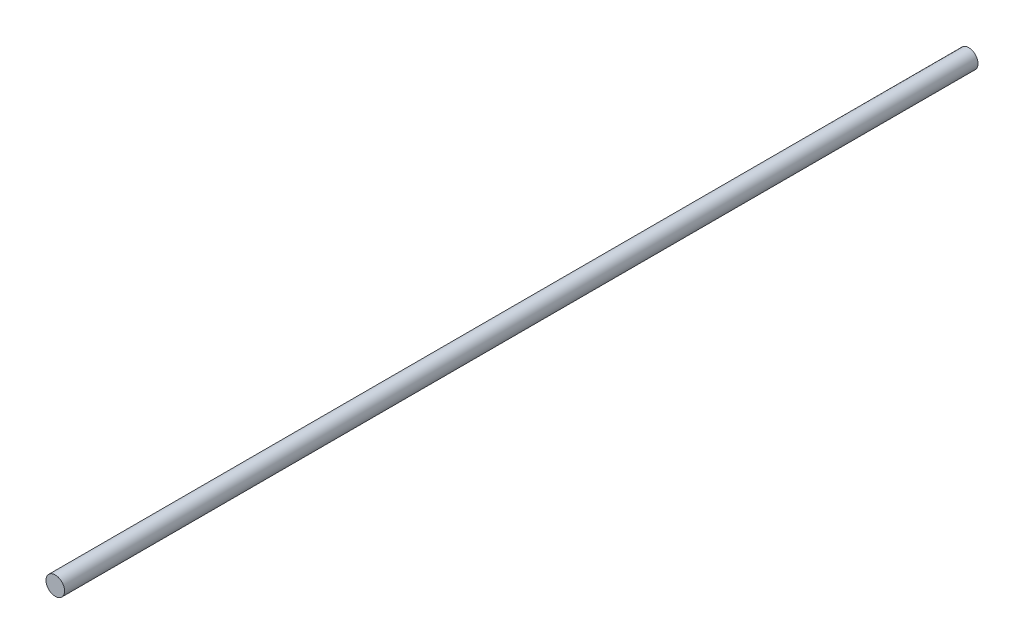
ISO-10303-21;
HEADER;
FILE_DESCRIPTION(('STEP AP214'),'2;1');
FILE_NAME('part.step','',(''),(''),'','','');
FILE_SCHEMA(('AUTOMOTIVE_DESIGN { 1 0 10303 214 1 1 1 1 }'));
ENDSEC;
DATA;
#1=APPLICATION_CONTEXT('core data for automotive mechanical design processes');
#2=APPLICATION_PROTOCOL_DEFINITION('international standard','automotive_design',2000,#1);
#3=PRODUCT_CONTEXT('',#1,'mechanical');
#4=PRODUCT('Part','Part','',(#3));
#5=PRODUCT_RELATED_PRODUCT_CATEGORY('part','',(#4));
#6=PRODUCT_DEFINITION_FORMATION('','',#4);
#7=PRODUCT_DEFINITION_CONTEXT('part definition',#1,'design');
#8=PRODUCT_DEFINITION('design','',#6,#7);
#9=PRODUCT_DEFINITION_SHAPE('','',#8);
#10=(LENGTH_UNIT() NAMED_UNIT(*) SI_UNIT(.MILLI.,.METRE.));
#11=(NAMED_UNIT(*) PLANE_ANGLE_UNIT() SI_UNIT($,.RADIAN.));
#12=(NAMED_UNIT(*) SI_UNIT($,.STERADIAN.) SOLID_ANGLE_UNIT());
#13=UNCERTAINTY_MEASURE_WITH_UNIT(LENGTH_MEASURE(1.E-05),#10,'distance_accuracy_value','');
#14=(GEOMETRIC_REPRESENTATION_CONTEXT(3) GLOBAL_UNCERTAINTY_ASSIGNED_CONTEXT((#13)) GLOBAL_UNIT_ASSIGNED_CONTEXT((#10,
#11,#12)) REPRESENTATION_CONTEXT('',''));
#15=CARTESIAN_POINT('',(0.,0.,0.));
#16=DIRECTION('',(0.,0.,1.));
#17=DIRECTION('',(1.,0.,0.));
#18=AXIS2_PLACEMENT_3D('',#15,#16,#17);
#19=CARTESIAN_POINT('',(0.,0.,-2950.));
#20=DIRECTION('',(0.,0.,1.));
#21=DIRECTION('',(1.,0.,0.));
#22=AXIS2_PLACEMENT_3D('',#19,#20,#21);
#23=CYLINDRICAL_SURFACE('',#22,30.);
#24=CARTESIAN_POINT('',(0.,0.,-2950.));
#25=DIRECTION('',(0.,0.,1.));
#26=DIRECTION('',(1.,0.,0.));
#27=AXIS2_PLACEMENT_3D('',#24,#25,#26);
#28=CIRCLE('',#27,30.);
#29=CARTESIAN_POINT('',(30.,0.,-2950.));
#30=VERTEX_POINT('',#29);
#31=EDGE_CURVE('E10',#30,#30,#28,.T.);
#32=ORIENTED_EDGE('',*,*,#31,.T.);
#33=EDGE_LOOP('',(#32));
#34=FACE_BOUND('',#33,.T.);
#35=CARTESIAN_POINT('',(0.,0.,0.));
#36=DIRECTION('',(0.,0.,1.));
#37=DIRECTION('',(1.,0.,0.));
#38=AXIS2_PLACEMENT_3D('',#35,#36,#37);
#39=CIRCLE('',#38,30.);
#40=CARTESIAN_POINT('',(30.,0.,0.));
#41=VERTEX_POINT('',#40);
#42=EDGE_CURVE('E40',#41,#41,#39,.T.);
#43=ORIENTED_EDGE('',*,*,#42,.F.);
#44=EDGE_LOOP('',(#43));
#45=FACE_BOUND('',#44,.T.);
#46=ADVANCED_FACE('F37',(#34,#45),#23,.T.);
#47=CARTESIAN_POINT('',(0.,0.,-2950.));
#48=DIRECTION('',(0.,0.,1.));
#49=DIRECTION('',(1.,0.,0.));
#50=AXIS2_PLACEMENT_3D('',#47,#48,#49);
#51=PLANE('',#50);
#52=ORIENTED_EDGE('',*,*,#31,.F.);
#53=EDGE_LOOP('',(#52));
#54=FACE_BOUND('',#53,.T.);
#55=ADVANCED_FACE('F54',(#54),#51,.F.);
#56=CARTESIAN_POINT('',(0.,0.,0.));
#57=DIRECTION('',(0.,0.,1.));
#58=DIRECTION('',(1.,0.,0.));
#59=AXIS2_PLACEMENT_3D('',#56,#57,#58);
#60=PLANE('',#59);
#61=ORIENTED_EDGE('',*,*,#42,.T.);
#62=EDGE_LOOP('',(#61));
#63=FACE_BOUND('',#62,.T.);
#64=ADVANCED_FACE('F51',(#63),#60,.T.);
#65=CLOSED_SHELL('',(#46,#55,#64));
#66=MANIFOLD_SOLID_BREP('B2',#65);
#67=ADVANCED_BREP_SHAPE_REPRESENTATION('',(#18,#66),#14);
#68=SHAPE_DEFINITION_REPRESENTATION(#9,#67);
ENDSEC;
END-ISO-10303-21;
